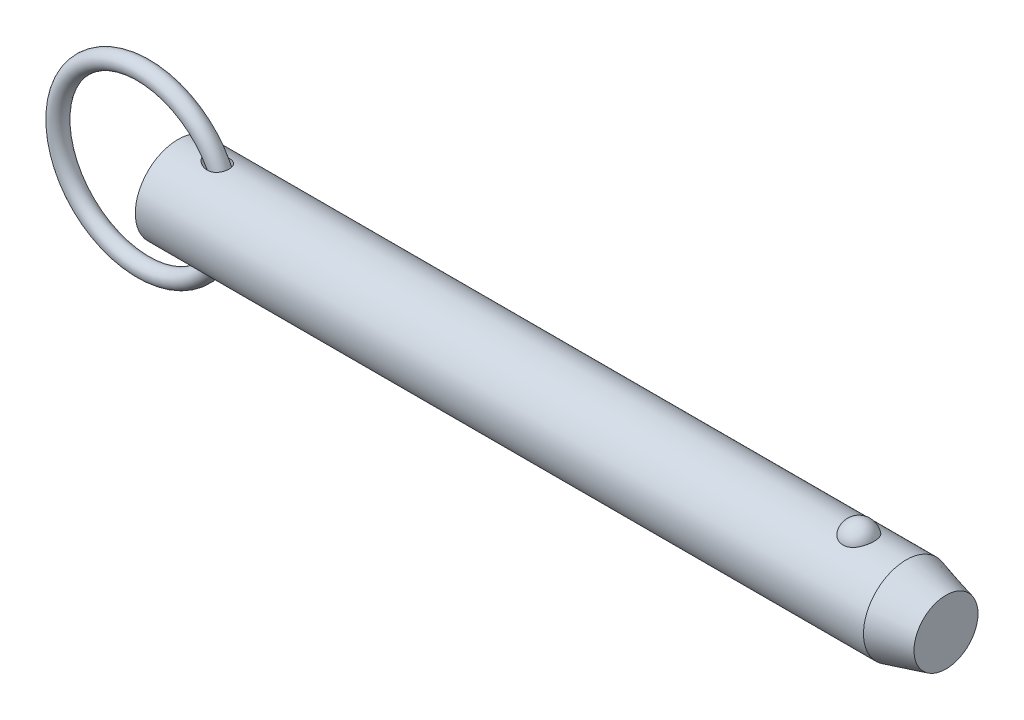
ISO-10303-21;
HEADER;
FILE_DESCRIPTION(('STEP AP214'),'2;1');
FILE_NAME('part.step','',(''),(''),'','','');
FILE_SCHEMA(('AUTOMOTIVE_DESIGN { 1 0 10303 214 1 1 1 1 }'));
ENDSEC;
DATA;
#1=APPLICATION_CONTEXT('core data for automotive mechanical design processes');
#2=APPLICATION_PROTOCOL_DEFINITION('international standard','automotive_design',2000,#1);
#3=PRODUCT_CONTEXT('',#1,'mechanical');
#4=PRODUCT('Part','Part','',(#3));
#5=PRODUCT_RELATED_PRODUCT_CATEGORY('part','',(#4));
#6=PRODUCT_DEFINITION_FORMATION('','',#4);
#7=PRODUCT_DEFINITION_CONTEXT('part definition',#1,'design');
#8=PRODUCT_DEFINITION('design','',#6,#7);
#9=PRODUCT_DEFINITION_SHAPE('','',#8);
#10=(LENGTH_UNIT() NAMED_UNIT(*) SI_UNIT(.MILLI.,.METRE.));
#11=(NAMED_UNIT(*) PLANE_ANGLE_UNIT() SI_UNIT($,.RADIAN.));
#12=(NAMED_UNIT(*) SI_UNIT($,.STERADIAN.) SOLID_ANGLE_UNIT());
#13=UNCERTAINTY_MEASURE_WITH_UNIT(LENGTH_MEASURE(1.E-05),#10,'distance_accuracy_value','');
#14=(GEOMETRIC_REPRESENTATION_CONTEXT(3) GLOBAL_UNCERTAINTY_ASSIGNED_CONTEXT((#13)) GLOBAL_UNIT_ASSIGNED_CONTEXT((#10,
#11,#12)) REPRESENTATION_CONTEXT('',''));
#15=CARTESIAN_POINT('',(0.,0.,0.));
#16=DIRECTION('',(0.,0.,1.));
#17=DIRECTION('',(1.,0.,0.));
#18=AXIS2_PLACEMENT_3D('',#15,#16,#17);
#19=CARTESIAN_POINT('',(-6.46799987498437,0.,0.));
#20=DIRECTION('',(0.,0.,1.));
#21=DIRECTION('',(1.,0.,0.));
#22=AXIS2_PLACEMENT_3D('',#19,#20,#21);
#23=TOROIDAL_SURFACE('',#22,15.875,1.588);
#24=CARTESIAN_POINT('',(10.9950001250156,0.,0.));
#25=VERTEX_POINT('',#24);
#26=VERTEX_LOOP('',#25);
#27=FACE_BOUND('',#26,.T.);
#28=ADVANCED_FACE('P0_F12',(#27),#23,.T.);
#29=CLOSED_SHELL('',(#28));
#30=MANIFOLD_SOLID_BREP('P0_B1',#29);
#31=CARTESIAN_POINT('',(0.,0.,0.));
#32=DIRECTION('',(1.,0.,0.));
#33=DIRECTION('',(0.,0.,-1.));
#34=AXIS2_PLACEMENT_3D('',#31,#32,#33);
#35=CYLINDRICAL_SURFACE('',#34,7.94);
#36=CARTESIAN_POINT('',(5.37881269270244,7.8641200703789,-1.0950869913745));
#37=CARTESIAN_POINT('',(5.49078530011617,7.84653010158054,-1.22142628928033));
#38=CARTESIAN_POINT('',(5.61742164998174,7.82766483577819,-1.33478448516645));
#39=CARTESIAN_POINT('',(5.82155225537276,7.80005811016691,-1.48501770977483));
#40=CARTESIAN_POINT('',(5.89211597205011,7.79095331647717,-1.53186949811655));
#41=CARTESIAN_POINT('',(6.03726296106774,7.77331484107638,-1.61899652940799));
#42=CARTESIAN_POINT('',(6.11184478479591,7.76478095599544,-1.65927412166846));
#43=CARTESIAN_POINT('',(6.31831542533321,7.74290334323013,-1.75933205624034));
#44=CARTESIAN_POINT('',(6.45343253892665,7.73042593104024,-1.81276183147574));
#45=CARTESIAN_POINT('',(6.73017339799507,7.70966096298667,-1.89912673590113));
#46=CARTESIAN_POINT('',(6.87179099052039,7.70136953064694,-1.93208083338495));
#47=CARTESIAN_POINT('',(7.17522096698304,7.6896684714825,-1.97820987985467));
#48=CARTESIAN_POINT('',(7.33750100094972,7.68691980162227,-1.98871513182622));
#49=CARTESIAN_POINT('',(7.5799424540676,7.68880305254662,-1.98137951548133));
#50=CARTESIAN_POINT('',(7.66059155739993,7.69043175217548,-1.97508575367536));
#51=CARTESIAN_POINT('',(7.82077465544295,7.69570110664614,-1.95445819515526));
#52=CARTESIAN_POINT('',(7.90030910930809,7.69934090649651,-1.94012781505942));
#53=CARTESIAN_POINT('',(8.092800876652,7.71066069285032,-1.89475688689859));
#54=CARTESIAN_POINT('',(8.2046520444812,7.71942251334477,-1.85909462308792));
#55=CARTESIAN_POINT('',(8.42059371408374,7.74035594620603,-1.7699066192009));
#56=CARTESIAN_POINT('',(8.52468939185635,7.75252525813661,-1.71639292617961));
#57=CARTESIAN_POINT('',(8.72211003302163,7.77903750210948,-1.59192358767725));
#58=CARTESIAN_POINT('',(8.81539818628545,7.79338749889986,-1.52091076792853));
#59=CARTESIAN_POINT('',(8.98759177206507,7.8225086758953,-1.363215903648));
#60=CARTESIAN_POINT('',(9.06649712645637,7.83727985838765,-1.27653377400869));
#61=CARTESIAN_POINT('',(9.20311499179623,7.86453692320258,-1.09567667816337));
#62=CARTESIAN_POINT('',(9.26180839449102,7.8771064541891,-1.00225329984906));
#63=CARTESIAN_POINT('',(9.36257622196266,7.89954213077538,-0.806547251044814));
#64=CARTESIAN_POINT('',(9.40465301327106,7.9094086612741,-0.704265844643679));
#65=CARTESIAN_POINT('',(9.47062404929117,7.92520709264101,-0.495461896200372));
#66=CARTESIAN_POINT('',(9.49478817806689,7.9311972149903,-0.389028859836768));
#67=CARTESIAN_POINT('',(9.52544004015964,7.93883641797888,-0.173494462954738));
#68=CARTESIAN_POINT('',(9.53192786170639,7.94048552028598,-0.0643931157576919));
#69=CARTESIAN_POINT('',(9.52707996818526,7.93926454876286,0.153487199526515));
#70=CARTESIAN_POINT('',(9.51572796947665,7.93639034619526,0.262265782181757));
#71=CARTESIAN_POINT('',(9.47542322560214,7.92642470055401,0.476313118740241));
#72=CARTESIAN_POINT('',(9.44647056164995,7.91933327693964,0.581581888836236));
#73=CARTESIAN_POINT('',(9.3716401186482,7.90170355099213,0.785602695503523));
#74=CARTESIAN_POINT('',(9.32576415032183,7.89116561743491,0.884355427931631));
#75=CARTESIAN_POINT('',(9.21823065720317,7.8677977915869,1.07254831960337));
#76=CARTESIAN_POINT('',(9.15657431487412,7.85496807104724,1.16198917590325));
#77=CARTESIAN_POINT('',(9.01919194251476,7.82843688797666,1.32903649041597));
#78=CARTESIAN_POINT('',(8.94347744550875,7.81473614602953,1.40665255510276));
#79=CARTESIAN_POINT('',(8.78012086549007,7.7879321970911,1.54819779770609));
#80=CARTESIAN_POINT('',(8.69247914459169,7.77482897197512,1.61212739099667));
#81=CARTESIAN_POINT('',(8.50642314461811,7.75037063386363,1.72592270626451));
#82=CARTESIAN_POINT('',(8.40786430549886,7.73904540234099,1.77555777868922));
#83=CARTESIAN_POINT('',(8.2039870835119,7.71943979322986,1.85894844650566));
#84=CARTESIAN_POINT('',(8.0986670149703,7.71116017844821,1.89270006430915));
#85=CARTESIAN_POINT('',(7.87703213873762,7.69782475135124,1.94625652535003));
#86=CARTESIAN_POINT('',(7.76044899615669,7.69301557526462,1.96500324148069));
#87=CARTESIAN_POINT('',(7.52574256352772,7.68770484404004,1.98567257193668));
#88=CARTESIAN_POINT('',(7.40761868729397,7.68720497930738,1.98758858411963));
#89=CARTESIAN_POINT('',(7.15639592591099,7.69044495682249,1.97502233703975));
#90=CARTESIAN_POINT('',(7.02341871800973,7.69476380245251,1.9583009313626));
#91=CARTESIAN_POINT('',(6.7612589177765,7.70776394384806,1.90648094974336));
#92=CARTESIAN_POINT('',(6.63208047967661,7.71644984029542,1.87136299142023));
#93=CARTESIAN_POINT('',(6.35978215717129,7.73875442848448,1.7770773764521));
#94=CARTESIAN_POINT('',(6.21772122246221,7.75293863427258,1.71496895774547));
#95=CARTESIAN_POINT('',(5.94559201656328,7.78383102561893,1.56880760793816));
#96=CARTESIAN_POINT('',(5.81552062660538,7.80053855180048,1.48476040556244));
#97=CARTESIAN_POINT('',(5.60081087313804,7.83035955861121,1.31701356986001));
#98=CARTESIAN_POINT('',(5.51265224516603,7.84340226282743,1.23780647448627));
#99=CARTESIAN_POINT('',(5.34976240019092,7.86852524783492,1.06647953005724));
#100=CARTESIAN_POINT('',(5.27500719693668,7.88060722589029,0.974383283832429));
#101=CARTESIAN_POINT('',(5.15877594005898,7.89990441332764,0.800548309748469));
#102=CARTESIAN_POINT('',(5.11360209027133,7.90759876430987,0.721348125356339));
#103=CARTESIAN_POINT('',(5.03655060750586,7.92090267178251,0.556518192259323));
#104=CARTESIAN_POINT('',(5.00466157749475,7.92651401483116,0.470894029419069));
#105=CARTESIAN_POINT('',(4.95653766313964,7.93503671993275,0.294356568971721));
#106=CARTESIAN_POINT('',(4.94043621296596,7.93792505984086,0.203404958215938));
#107=CARTESIAN_POINT('',(4.92605720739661,7.94050250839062,0.0200631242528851));
#108=CARTESIAN_POINT('',(4.92776929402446,7.9401934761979,-0.0723262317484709));
#109=CARTESIAN_POINT('',(4.94742735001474,7.93667454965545,-0.243250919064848));
#110=CARTESIAN_POINT('',(4.96327131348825,7.93384031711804,-0.322048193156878));
#111=CARTESIAN_POINT('',(5.00707570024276,7.92609115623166,-0.476058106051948));
#112=CARTESIAN_POINT('',(5.03503965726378,7.92117562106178,-0.551269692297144));
#113=CARTESIAN_POINT('',(5.10737112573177,7.90866290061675,-0.709995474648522));
#114=CARTESIAN_POINT('',(5.15379379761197,7.90074105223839,-0.792541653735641));
#115=CARTESIAN_POINT('',(5.25820836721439,7.88338732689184,-0.949781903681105));
#116=CARTESIAN_POINT('',(5.31621941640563,7.87395295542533,-1.02446265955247));
#117=CARTESIAN_POINT('',(5.37881269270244,7.8641200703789,-1.0950869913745));
#118=B_SPLINE_CURVE_WITH_KNOTS('',3,(#36,#37,#38,#39,#40,#41,#42,#43,#44,#45,#46,#47,#48,#49,
#50,#51,#52,#53,#54,#55,#56,#57,#58,#59,#60,#61,#62,#63,#64,#65,#66,#67,#68,#69,#70,#71,#72,#73,
#74,#75,#76,#77,#78,#79,#80,#81,#82,#83,#84,#85,#86,#87,#88,#89,#90,#91,#92,#93,#94,#95,#96,#97,
#98,#99,#100,#101,#102,#103,#104,#105,#106,#107,#108,#109,#110,#111,#112,#113,#114,#115,#116,
#117),.UNSPECIFIED.,.T.,.F.,(4,2,2,2,2,2,2,2,2,2,2,2,2,2,2,2,2,2,2,2,2,2,2,2,2,2,2,2,2,2,2,2,2,
2,2,2,2,2,2,2,4),(0.,0.508599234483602,0.763935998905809,1.01918131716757,1.45492798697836,
1.89027038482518,2.37502798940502,2.61739702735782,2.85966310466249,3.21120678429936,
3.56251370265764,3.91498401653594,4.26745624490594,4.59897839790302,4.93045331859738,
5.25682643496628,5.58319792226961,5.90986748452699,6.23653553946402,6.5631686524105,
6.88977729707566,7.21611917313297,7.54245114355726,7.8737863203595,8.20520442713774,
8.55832700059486,8.91158808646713,9.31234018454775,9.71351536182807,10.1786231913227,
10.6436096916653,11.0001264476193,11.3559986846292,11.6294791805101,11.9027245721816,
12.1782599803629,12.4536351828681,12.693828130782,12.9340911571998,13.2179277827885,
13.5022374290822),.UNSPECIFIED.);
#119=CARTESIAN_POINT('',(5.37881269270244,7.8641200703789,-1.0950869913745));
#120=VERTEX_POINT('',#119);
#121=EDGE_CURVE('P1_E40',#120,#120,#118,.T.);
#122=ORIENTED_EDGE('',*,*,#121,.T.);
#123=EDGE_LOOP('',(#122));
#124=FACE_BOUND('',#123,.T.);
#125=CARTESIAN_POINT('',(135.471879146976,0.,0.));
#126=DIRECTION('',(1.,0.,0.));
#127=DIRECTION('',(0.,0.,-1.));
#128=AXIS2_PLACEMENT_3D('',#125,#126,#127);
#129=CIRCLE('',#128,7.94);
#130=CARTESIAN_POINT('',(135.471879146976,0.,-7.94));
#131=VERTEX_POINT('',#130);
#132=EDGE_CURVE('P1_E25',#131,#131,#129,.T.);
#133=ORIENTED_EDGE('',*,*,#132,.F.);
#134=EDGE_LOOP('',(#133));
#135=FACE_BOUND('',#134,.T.);
#136=CARTESIAN_POINT('',(0.,0.,0.));
#137=DIRECTION('',(1.,0.,0.));
#138=DIRECTION('',(0.,0.,-1.));
#139=AXIS2_PLACEMENT_3D('',#136,#137,#138);
#140=CIRCLE('',#139,7.94);
#141=CARTESIAN_POINT('',(0.,0.,-7.94));
#142=VERTEX_POINT('',#141);
#143=EDGE_CURVE('P1_E9',#142,#142,#140,.T.);
#144=ORIENTED_EDGE('',*,*,#143,.T.);
#145=EDGE_LOOP('',(#144));
#146=FACE_BOUND('',#145,.T.);
#147=CARTESIAN_POINT('',(126.664907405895,7.37767842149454,2.93486986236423));
#148=CARTESIAN_POINT('',(126.512749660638,7.3776732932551,2.93487505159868));
#149=CARTESIAN_POINT('',(126.360632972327,7.38258419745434,2.92262454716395));
#150=CARTESIAN_POINT('',(126.060928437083,7.40163229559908,2.87404196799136));
#151=CARTESIAN_POINT('',(125.913339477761,7.41576720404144,2.83771585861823));
#152=CARTESIAN_POINT('',(125.627018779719,7.4516157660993,2.74218769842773));
#153=CARTESIAN_POINT('',(125.488274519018,7.47331841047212,2.68301886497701));
#154=CARTESIAN_POINT('',(125.222882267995,7.52194082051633,2.54350967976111));
#155=CARTESIAN_POINT('',(125.096236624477,7.5488615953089,2.46316523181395));
#156=CARTESIAN_POINT('',(124.854534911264,7.60594671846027,2.28090375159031));
#157=CARTESIAN_POINT('',(124.739906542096,7.63618114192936,2.1784421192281));
#158=CARTESIAN_POINT('',(124.528878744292,7.69614046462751,1.95608495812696));
#159=CARTESIAN_POINT('',(124.432482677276,7.72586526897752,1.83618622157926));
#160=CARTESIAN_POINT('',(124.255938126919,7.78314821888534,1.57628086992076));
#161=CARTESIAN_POINT('',(124.176707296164,7.81055035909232,1.43561546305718));
#162=CARTESIAN_POINT('',(124.041797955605,7.85879631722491,1.14236334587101));
#163=CARTESIAN_POINT('',(123.986121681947,7.87963951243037,0.989775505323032));
#164=CARTESIAN_POINT('',(123.89881215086,7.91289645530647,0.674619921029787));
#165=CARTESIAN_POINT('',(123.86753090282,7.92518652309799,0.511941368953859));
#166=CARTESIAN_POINT('',(123.830975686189,7.93958930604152,0.183247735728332));
#167=CARTESIAN_POINT('',(123.825701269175,7.94170219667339,0.0172327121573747));
#168=CARTESIAN_POINT('',(123.841231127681,7.93554931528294,-0.31267286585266));
#169=CARTESIAN_POINT('',(123.861925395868,7.92732732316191,-0.476569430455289));
#170=CARTESIAN_POINT('',(123.92878655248,7.90141534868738,-0.798305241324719));
#171=CARTESIAN_POINT('',(123.974953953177,7.88372517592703,-0.956144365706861));
#172=CARTESIAN_POINT('',(124.091898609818,7.84066230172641,-1.2615207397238));
#173=CARTESIAN_POINT('',(124.162704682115,7.81528060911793,-1.40904568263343));
#174=CARTESIAN_POINT('',(124.327478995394,7.75948672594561,-1.68950598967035));
#175=CARTESIAN_POINT('',(124.421448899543,7.72907417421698,-1.82244030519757));
#176=CARTESIAN_POINT('',(124.630839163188,7.66640424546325,-2.07032792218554));
#177=CARTESIAN_POINT('',(124.746315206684,7.63414223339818,-2.1852330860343));
#178=CARTESIAN_POINT('',(124.9959006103,7.57149681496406,-2.39329737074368));
#179=CARTESIAN_POINT('',(125.130008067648,7.54111321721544,-2.48645870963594));
#180=CARTESIAN_POINT('',(125.410111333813,7.48650742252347,-2.64628132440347));
#181=CARTESIAN_POINT('',(125.555760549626,7.46215900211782,-2.71350554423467));
#182=CARTESIAN_POINT('',(125.857425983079,7.42171253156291,-2.82226614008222));
#183=CARTESIAN_POINT('',(126.013438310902,7.40561140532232,-2.86381209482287));
#184=CARTESIAN_POINT('',(126.322970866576,7.3842679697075,-2.9183907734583));
#185=CARTESIAN_POINT('',(126.476222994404,7.37852109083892,-2.93275024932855));
#186=CARTESIAN_POINT('',(126.783070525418,7.37700973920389,-2.93655208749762));
#187=CARTESIAN_POINT('',(126.936665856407,7.38124333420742,-2.92599927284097));
#188=CARTESIAN_POINT('',(127.234990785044,7.39890635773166,-2.88102897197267));
#189=CARTESIAN_POINT('',(127.379848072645,7.41205491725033,-2.84733999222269));
#190=CARTESIAN_POINT('',(127.66164329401,7.445801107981,-2.75788206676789));
#191=CARTESIAN_POINT('',(127.798580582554,7.46639934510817,-2.70211132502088));
#192=CARTESIAN_POINT('',(128.064061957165,7.51339098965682,-2.56858908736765));
#193=CARTESIAN_POINT('',(128.192354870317,7.53990200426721,-2.4903806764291));
#194=CARTESIAN_POINT('',(128.434244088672,7.59569503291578,-2.31462737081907));
#195=CARTESIAN_POINT('',(128.547837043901,7.6249776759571,-2.21707808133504));
#196=CARTESIAN_POINT('',(128.76322156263,7.68489473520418,-1.99982049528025));
#197=CARTESIAN_POINT('',(128.864148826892,7.71552419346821,-1.87925337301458));
#198=CARTESIAN_POINT('',(129.045186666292,7.77353016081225,-1.6226882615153));
#199=CARTESIAN_POINT('',(129.125293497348,7.80090608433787,-1.48668750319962));
#200=CARTESIAN_POINT('',(129.265361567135,7.85047992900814,-1.1981841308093));
#201=CARTESIAN_POINT('',(129.324587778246,7.87248183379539,-1.04529016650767));
#202=CARTESIAN_POINT('',(129.417982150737,7.90785114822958,-0.731080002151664));
#203=CARTESIAN_POINT('',(129.452149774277,7.92121837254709,-0.56976362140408));
#204=CARTESIAN_POINT('',(129.494795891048,7.93797834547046,-0.242812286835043));
#205=CARTESIAN_POINT('',(129.503204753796,7.94134405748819,-0.0771668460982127));
#206=CARTESIAN_POINT('',(129.493962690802,7.93767937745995,0.253276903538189));
#207=CARTESIAN_POINT('',(129.476312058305,7.93064910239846,0.41807522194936));
#208=CARTESIAN_POINT('',(129.415424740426,7.90695571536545,0.741525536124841));
#209=CARTESIAN_POINT('',(129.372281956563,7.8903279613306,0.900197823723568));
#210=CARTESIAN_POINT('',(129.26135358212,7.84916386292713,1.20759654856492));
#211=CARTESIAN_POINT('',(129.19356656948,7.82462706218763,1.35632241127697));
#212=CARTESIAN_POINT('',(129.034371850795,7.7700669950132,1.64032869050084));
#213=CARTESIAN_POINT('',(128.942861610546,7.74002008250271,1.77554712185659));
#214=CARTESIAN_POINT('',(128.738296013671,7.67774175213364,2.02800648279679));
#215=CARTESIAN_POINT('',(128.625241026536,7.64551037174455,2.14524772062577));
#216=CARTESIAN_POINT('',(128.380831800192,7.58265895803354,2.35778002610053));
#217=CARTESIAN_POINT('',(128.249583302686,7.5520309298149,2.45319004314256));
#218=CARTESIAN_POINT('',(127.971601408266,7.49579792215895,2.61999897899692));
#219=CARTESIAN_POINT('',(127.824867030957,7.47019326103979,2.69139637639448));
#220=CARTESIAN_POINT('',(127.512947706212,7.42622216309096,2.8105324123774));
#221=CARTESIAN_POINT('',(127.347220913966,7.40825002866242,2.85700910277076));
#222=CARTESIAN_POINT('',(127.009279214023,7.38398348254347,2.9191685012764));
#223=CARTESIAN_POINT('',(126.83706702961,7.3776842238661,2.93486399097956));
#224=CARTESIAN_POINT('',(126.664907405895,7.37767842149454,2.93486986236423));
#225=B_SPLINE_CURVE_WITH_KNOTS('',3,(#147,#148,#149,#150,#151,#152,#153,#154,#155,#156,#157,
#158,#159,#160,#161,#162,#163,#164,#165,#166,#167,#168,#169,#170,#171,#172,#173,#174,#175,#176,
#177,#178,#179,#180,#181,#182,#183,#184,#185,#186,#187,#188,#189,#190,#191,#192,#193,#194,#195,
#196,#197,#198,#199,#200,#201,#202,#203,#204,#205,#206,#207,#208,#209,#210,#211,#212,#213,#214,
#215,#216,#217,#218,#219,#220,#221,#222,#223,#224),.UNSPECIFIED.,.T.,.F.,(4,2,2,2,2,2,2,2,2,2,2,
2,2,2,2,2,2,2,2,2,2,2,2,2,2,2,2,2,2,2,2,2,2,2,2,2,2,2,4),(0.,0.455841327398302,
0.911569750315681,1.36663794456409,1.8217942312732,2.28978983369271,2.75787163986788,
3.24685368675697,3.73588214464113,4.23184282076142,4.72779494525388,5.22165321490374,
5.71552141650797,6.20996917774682,6.7044524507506,7.20023431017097,7.69596557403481,
8.18023418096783,8.66432203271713,9.12410697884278,9.58380291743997,10.0296503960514,
10.4755341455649,10.9312349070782,11.3870393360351,11.8654416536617,12.3439299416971,
12.8378875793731,13.3318558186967,13.8271581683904,14.3224549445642,14.8159385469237,
15.3094506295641,15.8051323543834,16.3008055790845,16.7937101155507,17.2866458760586,
17.8026240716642,18.3183879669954),.UNSPECIFIED.);
#226=CARTESIAN_POINT('',(126.664907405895,7.37767842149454,2.93486986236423));
#227=VERTEX_POINT('',#226);
#228=EDGE_CURVE('P1_E34',#227,#227,#225,.T.);
#229=ORIENTED_EDGE('',*,*,#228,.T.);
#230=EDGE_LOOP('',(#229));
#231=FACE_BOUND('',#230,.T.);
#232=CARTESIAN_POINT('',(5.37881269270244,-7.8641200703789,-1.0950869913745));
#233=CARTESIAN_POINT('',(5.31532711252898,-7.87409326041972,-1.02345575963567));
#234=CARTESIAN_POINT('',(5.25654962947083,-7.88365715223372,-0.947641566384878));
#235=CARTESIAN_POINT('',(5.15093536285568,-7.90122221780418,-0.787865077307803));
#236=CARTESIAN_POINT('',(5.10408931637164,-7.90922460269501,-0.703909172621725));
#237=CARTESIAN_POINT('',(5.02499142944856,-7.92292057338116,-0.5279916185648));
#238=CARTESIAN_POINT('',(4.99290048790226,-7.92858863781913,-0.435954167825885));
#239=CARTESIAN_POINT('',(4.94718343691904,-7.93670712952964,-0.247266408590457));
#240=CARTESIAN_POINT('',(4.93353142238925,-7.93916207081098,-0.150622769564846));
#241=CARTESIAN_POINT('',(4.92669426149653,-7.94038957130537,0.0306459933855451));
#242=CARTESIAN_POINT('',(4.9310562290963,-7.93960347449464,0.115182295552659));
#243=CARTESIAN_POINT('',(4.95441758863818,-7.93542535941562,0.282133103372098));
#244=CARTESIAN_POINT('',(4.97342060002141,-7.93203269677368,0.364547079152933));
#245=CARTESIAN_POINT('',(5.02337664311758,-7.92322764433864,0.521528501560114));
#246=CARTESIAN_POINT('',(5.05377582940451,-7.91790920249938,0.596281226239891));
#247=CARTESIAN_POINT('',(5.1246872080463,-7.90571364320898,0.74064062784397));
#248=CARTESIAN_POINT('',(5.16520358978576,-7.89883588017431,0.810245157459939));
#249=CARTESIAN_POINT('',(5.27792634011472,-7.88012470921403,0.978620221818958));
#250=CARTESIAN_POINT('',(5.35563200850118,-7.86757912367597,1.07363778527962));
#251=CARTESIAN_POINT('',(5.52523836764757,-7.84150676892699,1.24994147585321));
#252=CARTESIAN_POINT('',(5.61717506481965,-7.82797755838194,1.33119164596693));
#253=CARTESIAN_POINT('',(5.83913717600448,-7.79742756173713,1.50104748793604));
#254=CARTESIAN_POINT('',(5.97257429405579,-7.78050347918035,1.58521567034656));
#255=CARTESIAN_POINT('',(6.25160600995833,-7.74942135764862,1.73078109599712));
#256=CARTESIAN_POINT('',(6.39720857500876,-7.73526515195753,1.79216327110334));
#257=CARTESIAN_POINT('',(6.69793322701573,-7.7116170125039,1.8913447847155));
#258=CARTESIAN_POINT('',(6.85312134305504,-7.70216275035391,1.92895428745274));
#259=CARTESIAN_POINT('',(7.16781951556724,-7.68988337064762,1.97736316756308));
#260=CARTESIAN_POINT('',(7.32732244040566,-7.68704791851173,1.98820434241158));
#261=CARTESIAN_POINT('',(7.612907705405,-7.68890797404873,1.98097687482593));
#262=CARTESIAN_POINT('',(7.73913797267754,-7.69217875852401,1.96837928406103));
#263=CARTESIAN_POINT('',(7.98774248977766,-7.70364253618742,1.92303262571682));
#264=CARTESIAN_POINT('',(8.11011880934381,-7.71183283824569,1.89029457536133));
#265=CARTESIAN_POINT('',(8.34766306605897,-7.73253074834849,1.80375920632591));
#266=CARTESIAN_POINT('',(8.46278682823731,-7.74506226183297,1.74984505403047));
#267=CARTESIAN_POINT('',(8.68062682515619,-7.77294147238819,1.62149891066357));
#268=CARTESIAN_POINT('',(8.78334736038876,-7.78828818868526,1.54707406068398));
#269=CARTESIAN_POINT('',(8.9627595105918,-7.81808719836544,1.38814746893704));
#270=CARTESIAN_POINT('',(9.04102925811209,-7.83247448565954,1.30540890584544));
#271=CARTESIAN_POINT('',(9.18176824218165,-7.86008608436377,1.12727331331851));
#272=CARTESIAN_POINT('',(9.24424163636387,-7.87331070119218,1.03187962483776));
#273=CARTESIAN_POINT('',(9.34924815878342,-7.89649032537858,0.835684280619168));
#274=CARTESIAN_POINT('',(9.39252490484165,-7.90656172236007,0.735293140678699));
#275=CARTESIAN_POINT('',(9.46188913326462,-7.92307290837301,0.528458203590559));
#276=CARTESIAN_POINT('',(9.48797767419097,-7.92951292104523,0.422014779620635));
#277=CARTESIAN_POINT('',(9.52228670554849,-7.93804067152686,0.206589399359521));
#278=CARTESIAN_POINT('',(9.53058328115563,-7.94014694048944,0.0976202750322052));
#279=CARTESIAN_POINT('',(9.52935292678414,-7.93983698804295,-0.120212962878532));
#280=CARTESIAN_POINT('',(9.51982577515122,-7.9374207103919,-0.229077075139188));
#281=CARTESIAN_POINT('',(9.48313466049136,-7.92831916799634,-0.443751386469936));
#282=CARTESIAN_POINT('',(9.45594838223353,-7.92162850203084,-0.549557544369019));
#283=CARTESIAN_POINT('',(9.38454658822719,-7.90469917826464,-0.754954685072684));
#284=CARTESIAN_POINT('',(9.34033171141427,-7.89446065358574,-0.85454590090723));
#285=CARTESIAN_POINT('',(9.23602927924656,-7.87157146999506,-1.04456732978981));
#286=CARTESIAN_POINT('',(9.17596171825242,-7.85892385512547,-1.13500888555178));
#287=CARTESIAN_POINT('',(9.0415343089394,-7.83259746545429,-1.30436780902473));
#288=CARTESIAN_POINT('',(8.96717562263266,-7.81891877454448,-1.38328611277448));
#289=CARTESIAN_POINT('',(8.80603455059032,-7.79196869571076,-1.52782923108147));
#290=CARTESIAN_POINT('',(8.71921490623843,-7.77869867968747,-1.59341269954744));
#291=CARTESIAN_POINT('',(8.53589430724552,-7.7539823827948,-1.70964937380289));
#292=CARTESIAN_POINT('',(8.43939269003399,-7.74253622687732,-1.76030155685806));
#293=CARTESIAN_POINT('',(8.23614706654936,-7.72219212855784,-1.84754820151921));
#294=CARTESIAN_POINT('',(8.12916866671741,-7.71339202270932,-1.88361685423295));
#295=CARTESIAN_POINT('',(7.91082287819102,-7.69955300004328,-1.93940887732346));
#296=CARTESIAN_POINT('',(7.79945379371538,-7.69451555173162,-1.95912586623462));
#297=CARTESIAN_POINT('',(7.56409927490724,-7.6881073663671,-1.98413612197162));
#298=CARTESIAN_POINT('',(7.43993744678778,-7.68713944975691,-1.98784574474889));
#299=CARTESIAN_POINT('',(7.19239878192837,-7.68969629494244,-1.97792309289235));
#300=CARTESIAN_POINT('',(7.0690222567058,-7.69322274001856,-1.96428432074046));
#301=CARTESIAN_POINT('',(6.80624991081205,-7.70498367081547,-1.91768089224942));
#302=CARTESIAN_POINT('',(6.667361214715,-7.71386737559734,-1.88203087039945));
#303=CARTESIAN_POINT('',(6.39625444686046,-7.73551250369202,-1.79098714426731));
#304=CARTESIAN_POINT('',(6.26404857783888,-7.74828074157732,-1.73555871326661));
#305=CARTESIAN_POINT('',(6.06559048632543,-7.77003865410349,-1.63446133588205));
#306=CARTESIAN_POINT('',(5.99591479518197,-7.77821880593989,-1.59522999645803));
#307=CARTESIAN_POINT('',(5.86025875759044,-7.79503524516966,-1.51091846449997));
#308=CARTESIAN_POINT('',(5.79427944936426,-7.80367165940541,-1.46583664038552));
#309=CARTESIAN_POINT('',(5.60322733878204,-7.82978128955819,-1.3219827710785));
#310=CARTESIAN_POINT('',(5.4844964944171,-7.84751780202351,-1.21433077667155));
#311=CARTESIAN_POINT('',(5.37881269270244,-7.8641200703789,-1.0950869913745));
#312=B_SPLINE_CURVE_WITH_KNOTS('',3,(#232,#233,#234,#235,#236,#237,#238,#239,#240,#241,#242,
#243,#244,#245,#246,#247,#248,#249,#250,#251,#252,#253,#254,#255,#256,#257,#258,#259,#260,#261,
#262,#263,#264,#265,#266,#267,#268,#269,#270,#271,#272,#273,#274,#275,#276,#277,#278,#279,#280,
#281,#282,#283,#284,#285,#286,#287,#288,#289,#290,#291,#292,#293,#294,#295,#296,#297,#298,#299,
#300,#301,#302,#303,#304,#305,#306,#307,#308,#309,#310,#311),.UNSPECIFIED.,.T.,.F.,(4,2,2,2,2,2,
2,2,2,2,2,2,2,2,2,2,2,2,2,2,2,2,2,2,2,2,2,2,2,2,2,2,2,2,2,2,2,2,2,4),(0.,0.288363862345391,
0.576503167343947,0.867714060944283,1.15851540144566,1.41111828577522,1.66378363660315,
1.90549406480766,2.1473047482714,2.51540453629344,2.88445136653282,3.3580515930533,
3.83196445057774,4.30961543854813,4.78652012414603,5.16565662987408,5.54458592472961,
5.92563591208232,6.30655339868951,6.64920782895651,6.99177197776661,7.31956587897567,
7.64733959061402,7.97370879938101,8.30008206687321,8.62686856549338,8.95364280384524,
9.28000684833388,9.60634436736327,9.93367879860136,10.261035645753,10.59932199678,
10.9377403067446,11.308967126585,11.6803330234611,12.1096921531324,12.5398088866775,
12.7806650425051,13.0215885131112,13.5016249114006),.UNSPECIFIED.);
#313=CARTESIAN_POINT('',(5.37881269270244,-7.8641200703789,-1.0950869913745));
#314=VERTEX_POINT('',#313);
#315=EDGE_CURVE('P1_E17',#314,#314,#312,.T.);
#316=ORIENTED_EDGE('',*,*,#315,.T.);
#317=EDGE_LOOP('',(#316));
#318=FACE_BOUND('',#317,.T.);
#319=ADVANCED_FACE('P1_F13',(#124,#135,#146,#231,#318),#35,.T.);
#320=CARTESIAN_POINT('',(0.,0.,0.));
#321=DIRECTION('',(-1.,0.,0.));
#322=DIRECTION('',(0.,0.,1.));
#323=AXIS2_PLACEMENT_3D('',#320,#321,#322);
#324=PLANE('',#323);
#325=ORIENTED_EDGE('',*,*,#143,.F.);
#326=EDGE_LOOP('',(#325));
#327=FACE_BOUND('',#326,.T.);
#328=ADVANCED_FACE('P1_F15',(#327),#324,.T.);
#329=CARTESIAN_POINT('',(142.88,0.,0.));
#330=DIRECTION('',(-1.,0.,0.));
#331=DIRECTION('',(0.,0.,1.));
#332=AXIS2_PLACEMENT_3D('',#329,#330,#331);
#333=CONICAL_SURFACE('',#332,5.95500000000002,0.26179938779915);
#334=ORIENTED_EDGE('',*,*,#132,.T.);
#335=EDGE_LOOP('',(#334));
#336=FACE_BOUND('',#335,.T.);
#337=CARTESIAN_POINT('',(142.88,0.,0.));
#338=DIRECTION('',(1.,0.,0.));
#339=DIRECTION('',(0.,0.,-1.));
#340=AXIS2_PLACEMENT_3D('',#337,#338,#339);
#341=CIRCLE('',#340,5.95500000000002);
#342=CARTESIAN_POINT('',(142.88,0.,-5.95500000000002));
#343=VERTEX_POINT('',#342);
#344=EDGE_CURVE('P1_E30',#343,#343,#341,.T.);
#345=ORIENTED_EDGE('',*,*,#344,.F.);
#346=EDGE_LOOP('',(#345));
#347=FACE_BOUND('',#346,.T.);
#348=ADVANCED_FACE('P1_F55',(#336,#347),#333,.T.);
#349=CARTESIAN_POINT('',(142.88,5.95500000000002,0.));
#350=DIRECTION('',(1.,0.,0.));
#351=DIRECTION('',(0.,0.,-1.));
#352=AXIS2_PLACEMENT_3D('',#349,#350,#351);
#353=PLANE('',#352);
#354=ORIENTED_EDGE('',*,*,#344,.T.);
#355=EDGE_LOOP('',(#354));
#356=FACE_BOUND('',#355,.T.);
#357=ADVANCED_FACE('P1_F51',(#356),#353,.T.);
#358=CARTESIAN_POINT('',(126.664907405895,7.146,0.));
#359=DIRECTION('',(-1.,0.,0.));
#360=DIRECTION('',(0.,-1.,0.));
#361=AXIS2_PLACEMENT_3D('',#358,#359,#360);
#362=SPHERICAL_SURFACE('',#361,2.944);
#363=ORIENTED_EDGE('',*,*,#228,.F.);
#364=EDGE_LOOP('',(#363));
#365=FACE_BOUND('',#364,.T.);
#366=ADVANCED_FACE('P1_F46',(#365),#362,.T.);
#367=CARTESIAN_POINT('',(-6.46799987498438,0.,0.));
#368=DIRECTION('',(0.,0.,1.));
#369=DIRECTION('',(1.,0.,0.));
#370=AXIS2_PLACEMENT_3D('',#367,#368,#369);
#371=TOROIDAL_SURFACE('',#370,15.875,1.985);
#372=ORIENTED_EDGE('',*,*,#315,.F.);
#373=EDGE_LOOP('',(#372));
#374=FACE_BOUND('',#373,.T.);
#375=ORIENTED_EDGE('',*,*,#121,.F.);
#376=EDGE_LOOP('',(#375));
#377=FACE_BOUND('',#376,.T.);
#378=ADVANCED_FACE('P1_F50',(#374,#377),#371,.F.);
#379=CLOSED_SHELL('',(#319,#328,#348,#357,#366,#378));
#380=MANIFOLD_SOLID_BREP('P1_B1',#379);
#381=ADVANCED_BREP_SHAPE_REPRESENTATION('',(#18,#30,#380),#14);
#382=SHAPE_DEFINITION_REPRESENTATION(#9,#381);
ENDSEC;
END-ISO-10303-21;
